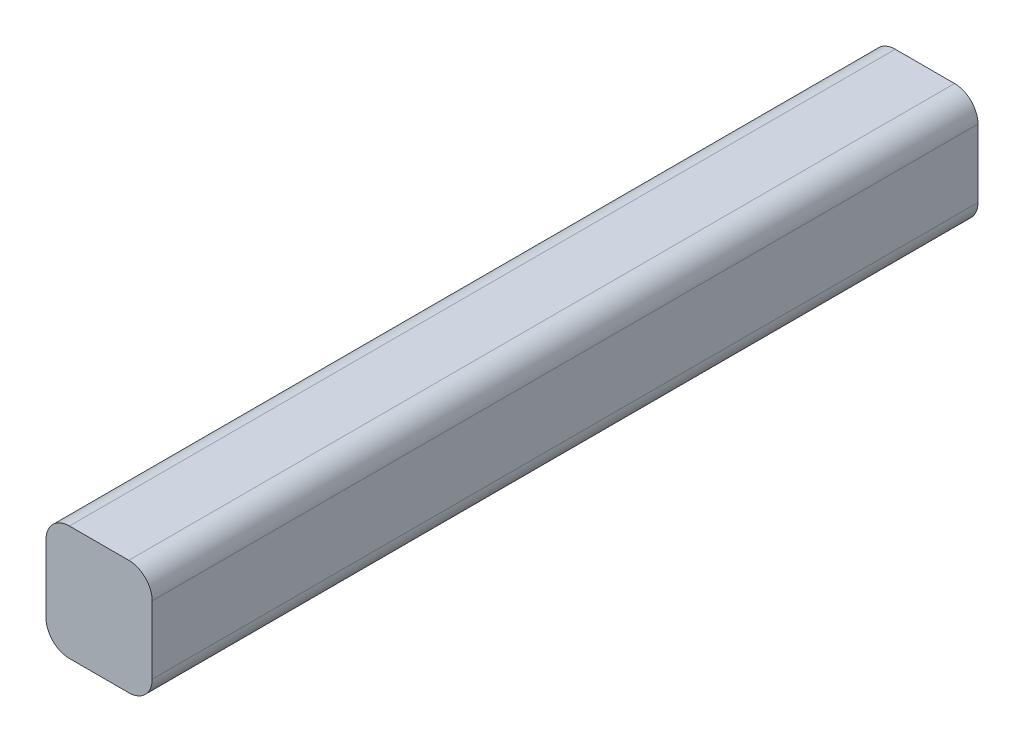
from build123d import *

# Parameters (mm, degrees)
SKETCH1_W           = 42.17
SKETCH1_H           = 45.57
BOSS_EXTRUDE1_DEPTH = 328
FILLET1_R           = 9.3


with BuildPart() as part:
    # Sketch1 → Boss-Extrude1 (new body)
    with BuildSketch(Plane.XY):
        with Locations((1.695, -0.005)):
            Rectangle(SKETCH1_W, SKETCH1_H)
    extrude(amount=BOSS_EXTRUDE1_DEPTH)

    # Fillet1
    fillet1_edges = [part.edges().sort_by_distance(p)[0] for p in [
        (22.78, 22.78, 164),
        (22.78, -22.79, 164),
        (-19.39, -22.79, 164),
        (-19.39, 22.78, 164),
    ]]
    fillet(fillet1_edges, radius=FILLET1_R)


solid = part.part
